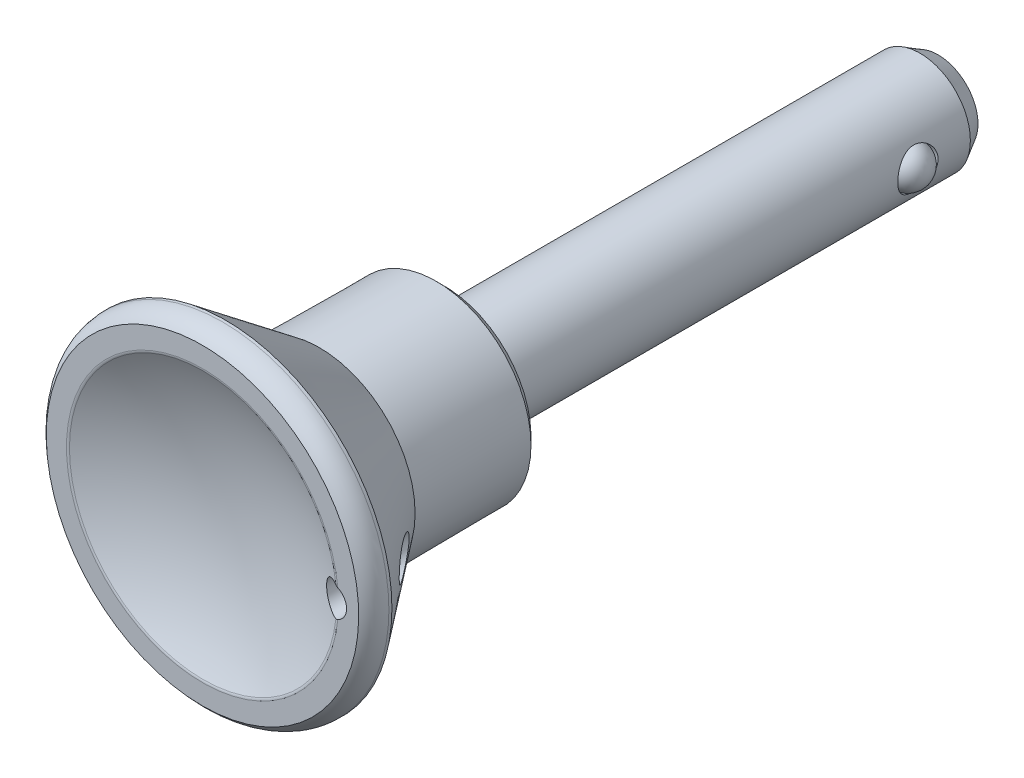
ISO-10303-21;
HEADER;
FILE_DESCRIPTION(('STEP AP214'),'2;1');
FILE_NAME('part.step','',(''),(''),'','','');
FILE_SCHEMA(('AUTOMOTIVE_DESIGN { 1 0 10303 214 1 1 1 1 }'));
ENDSEC;
DATA;
#1=APPLICATION_CONTEXT('core data for automotive mechanical design processes');
#2=APPLICATION_PROTOCOL_DEFINITION('international standard','automotive_design',2000,#1);
#3=PRODUCT_CONTEXT('',#1,'mechanical');
#4=PRODUCT('Part','Part','',(#3));
#5=PRODUCT_RELATED_PRODUCT_CATEGORY('part','',(#4));
#6=PRODUCT_DEFINITION_FORMATION('','',#4);
#7=PRODUCT_DEFINITION_CONTEXT('part definition',#1,'design');
#8=PRODUCT_DEFINITION('design','',#6,#7);
#9=PRODUCT_DEFINITION_SHAPE('','',#8);
#10=(LENGTH_UNIT() NAMED_UNIT(*) SI_UNIT(.MILLI.,.METRE.));
#11=(NAMED_UNIT(*) PLANE_ANGLE_UNIT() SI_UNIT($,.RADIAN.));
#12=(NAMED_UNIT(*) SI_UNIT($,.STERADIAN.) SOLID_ANGLE_UNIT());
#13=UNCERTAINTY_MEASURE_WITH_UNIT(LENGTH_MEASURE(1.E-05),#10,'distance_accuracy_value','');
#14=(GEOMETRIC_REPRESENTATION_CONTEXT(3) GLOBAL_UNCERTAINTY_ASSIGNED_CONTEXT((#13)) GLOBAL_UNIT_ASSIGNED_CONTEXT((#10,
#11,#12)) REPRESENTATION_CONTEXT('',''));
#15=CARTESIAN_POINT('',(0.,0.,0.));
#16=DIRECTION('',(0.,0.,1.));
#17=DIRECTION('',(1.,0.,0.));
#18=AXIS2_PLACEMENT_3D('',#15,#16,#17);
#19=CARTESIAN_POINT('',(0.,0.,23.5));
#20=DIRECTION('',(0.,0.,1.));
#21=DIRECTION('',(0.,-1.,0.));
#22=AXIS2_PLACEMENT_3D('',#19,#20,#21);
#23=TOROIDAL_SURFACE('',#22,13.4996296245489,0.50000000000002);
#24=CARTESIAN_POINT('',(13.1832697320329,1.4502083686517,23.940350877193));
#25=CARTESIAN_POINT('',(13.1967898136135,1.44663630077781,23.9473693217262));
#26=CARTESIAN_POINT('',(13.2105528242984,1.44279517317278,23.9537540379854));
#27=CARTESIAN_POINT('',(13.2384329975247,1.43456873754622,23.9652617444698));
#28=CARTESIAN_POINT('',(13.2525500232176,1.43018363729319,23.9703852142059));
#29=CARTESIAN_POINT('',(13.294658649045,1.41639274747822,23.9836925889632));
#30=CARTESIAN_POINT('',(13.322980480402,1.40620303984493,23.9901034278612));
#31=CARTESIAN_POINT('',(13.3645007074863,1.38980064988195,23.9961744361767));
#32=CARTESIAN_POINT('',(13.377775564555,1.38433480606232,23.9976116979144));
#33=CARTESIAN_POINT('',(13.4043485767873,1.37294329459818,23.9995283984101));
#34=CARTESIAN_POINT('',(13.4176457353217,1.3670137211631,23.999998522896));
#35=CARTESIAN_POINT('',(13.430859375,1.3608881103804,24.));
#36=B_SPLINE_CURVE_WITH_KNOTS('',3,(#24,#25,#26,#27,#28,#29,#30,#31,#32,#33,#34,#35),
.UNSPECIFIED.,.F.,.F.,(4,2,2,2,2,4),(0.,0.0468986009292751,0.0937793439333,0.185591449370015,
0.228845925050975,0.272515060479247),.UNSPECIFIED.);
#37=CARTESIAN_POINT('',(13.1832697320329,1.4502083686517,23.940350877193));
#38=VERTEX_POINT('',#37);
#39=CARTESIAN_POINT('',(13.430859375,1.36088811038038,24.));
#40=VERTEX_POINT('',#39);
#41=EDGE_CURVE('E60',#38,#40,#36,.T.);
#42=ORIENTED_EDGE('',*,*,#41,.T.);
#43=CARTESIAN_POINT('',(0.,0.,24.));
#44=DIRECTION('',(0.,0.,1.));
#45=DIRECTION('',(0.,-1.,0.));
#46=AXIS2_PLACEMENT_3D('',#43,#44,#45);
#47=CIRCLE('',#46,13.499629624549);
#48=CARTESIAN_POINT('',(13.430859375,-1.36088811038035,24.));
#49=VERTEX_POINT('',#48);
#50=EDGE_CURVE('E39',#49,#40,#47,.F.);
#51=ORIENTED_EDGE('',*,*,#50,.F.);
#52=CARTESIAN_POINT('',(13.430859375,-1.36088811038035,24.));
#53=CARTESIAN_POINT('',(13.4166665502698,-1.36746807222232,23.9999984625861));
#54=CARTESIAN_POINT('',(13.4023759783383,-1.37382175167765,23.9994558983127));
#55=CARTESIAN_POINT('',(13.3736641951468,-1.38605678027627,23.9972288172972));
#56=CARTESIAN_POINT('',(13.3592428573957,-1.39193760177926,23.9955430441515));
#57=CARTESIAN_POINT('',(13.316571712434,-1.4085689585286,23.9887845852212));
#58=CARTESIAN_POINT('',(13.2882736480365,-1.41860415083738,23.9820148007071));
#59=CARTESIAN_POINT('',(13.2473798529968,-1.43179699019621,23.9685266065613));
#60=CARTESIAN_POINT('',(13.2344037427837,-1.43578270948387,23.9636790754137));
#61=CARTESIAN_POINT('',(13.2086362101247,-1.44332889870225,23.9528611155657));
#62=CARTESIAN_POINT('',(13.1958479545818,-1.44688469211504,23.9468798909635));
#63=CARTESIAN_POINT('',(13.1832697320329,-1.45020836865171,23.940350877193));
#64=B_SPLINE_CURVE_WITH_KNOTS('',3,(#52,#53,#54,#55,#56,#57,#58,#59,#60,#61,#62,#63),
.UNSPECIFIED.,.F.,.F.,(4,2,2,2,2,4),(0.,0.0469051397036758,0.0938619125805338,0.185680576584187,
0.228880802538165,0.2725152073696),.UNSPECIFIED.);
#65=CARTESIAN_POINT('',(13.1832697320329,-1.4502083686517,23.940350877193));
#66=VERTEX_POINT('',#65);
#67=EDGE_CURVE('E20',#49,#66,#64,.T.);
#68=ORIENTED_EDGE('',*,*,#67,.T.);
#69=CARTESIAN_POINT('',(0.,0.,23.940350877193));
#70=DIRECTION('',(0.,0.,1.));
#71=DIRECTION('',(0.,-1.,0.));
#72=AXIS2_PLACEMENT_3D('',#69,#70,#71);
#73=CIRCLE('',#72,13.2627940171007);
#74=EDGE_CURVE('E54',#38,#66,#73,.T.);
#75=ORIENTED_EDGE('',*,*,#74,.F.);
#76=EDGE_LOOP('',(#42,#51,#68,#75));
#77=FACE_BOUND('',#76,.T.);
#78=ADVANCED_FACE('F15',(#77),#23,.T.);
#79=CARTESIAN_POINT('',(0.,0.,48.6));
#80=DIRECTION('',(0.,-1.,0.));
#81=DIRECTION('',(0.,0.,1.));
#82=AXIS2_PLACEMENT_3D('',#79,#80,#81);
#83=SPHERICAL_SURFACE('',#82,28.);
#84=CARTESIAN_POINT('',(13.1832697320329,1.4502083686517,23.940350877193));
#85=CARTESIAN_POINT('',(13.0915993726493,1.4744532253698,23.8927620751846));
#86=CARTESIAN_POINT('',(12.9980560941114,1.489860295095,23.8443501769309));
#87=CARTESIAN_POINT('',(12.8097591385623,1.50293318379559,23.7471842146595));
#88=CARTESIAN_POINT('',(12.7150040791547,1.50057651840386,23.6984297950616));
#89=CARTESIAN_POINT('',(12.5270201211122,1.47798913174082,23.6019874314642));
#90=CARTESIAN_POINT('',(12.4337919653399,1.45774995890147,23.5543000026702));
#91=CARTESIAN_POINT('',(12.2517517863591,1.39948117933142,23.4614379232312));
#92=CARTESIAN_POINT('',(12.1629377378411,1.36145981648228,23.416262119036));
#93=CARTESIAN_POINT('',(11.9952411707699,1.26934990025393,23.3311736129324));
#94=CARTESIAN_POINT('',(11.9161458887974,1.21575714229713,23.2911465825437));
#95=CARTESIAN_POINT('',(11.7681643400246,1.09295087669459,23.2164149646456));
#96=CARTESIAN_POINT('',(11.6992729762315,1.02374521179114,23.1817077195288));
#97=CARTESIAN_POINT('',(11.5811025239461,0.878735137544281,23.1222729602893));
#98=CARTESIAN_POINT('',(11.5305709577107,0.804216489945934,23.0969048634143));
#99=CARTESIAN_POINT('',(11.4431131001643,0.645771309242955,23.0530473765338));
#100=CARTESIAN_POINT('',(11.4061726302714,0.561854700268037,23.0345508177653));
#101=CARTESIAN_POINT('',(11.3518094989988,0.398913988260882,23.0073479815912));
#102=CARTESIAN_POINT('',(11.332464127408,0.32068873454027,22.9976766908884));
#103=CARTESIAN_POINT('',(11.3065630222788,0.161638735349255,22.9847305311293));
#104=CARTESIAN_POINT('',(11.3000015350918,0.0808151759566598,22.9814527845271));
#105=CARTESIAN_POINT('',(11.2999985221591,-0.0778011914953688,22.9814513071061));
#106=CARTESIAN_POINT('',(11.3060768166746,-0.155594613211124,22.9844877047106));
#107=CARTESIAN_POINT('',(11.3300927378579,-0.308850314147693,22.9964912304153));
#108=CARTESIAN_POINT('',(11.3480306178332,-0.384312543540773,23.0054584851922));
#109=CARTESIAN_POINT('',(11.3948947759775,-0.530632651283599,23.0289063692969));
#110=CARTESIAN_POINT('',(11.4237977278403,-0.601499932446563,23.0433752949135));
#111=CARTESIAN_POINT('',(11.4913996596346,-0.737094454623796,23.0772561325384));
#112=CARTESIAN_POINT('',(11.5301003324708,-0.801820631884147,23.0966688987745));
#113=CARTESIAN_POINT('',(11.6176766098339,-0.9263609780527,23.1406602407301));
#114=CARTESIAN_POINT('',(11.6669073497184,-0.98586052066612,23.1654195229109));
#115=CARTESIAN_POINT('',(11.7728262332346,-1.09578522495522,23.2187793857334));
#116=CARTESIAN_POINT('',(11.8295165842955,-1.14620769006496,23.2473811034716));
#117=CARTESIAN_POINT('',(11.9547131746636,-1.24189507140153,23.3106654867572));
#118=CARTESIAN_POINT('',(12.0238340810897,-1.28614058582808,23.3456702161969));
#119=CARTESIAN_POINT('',(12.1672246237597,-1.36242212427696,23.4184517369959));
#120=CARTESIAN_POINT('',(12.2414976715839,-1.39444996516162,23.4562303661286));
#121=CARTESIAN_POINT('',(12.3592920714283,-1.4344825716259,23.5162885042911));
#122=CARTESIAN_POINT('',(12.4017101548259,-1.44682505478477,23.5379430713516));
#123=CARTESIAN_POINT('',(12.4872184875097,-1.4676864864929,23.5816530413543));
#124=CARTESIAN_POINT('',(12.5303081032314,-1.47620883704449,23.603708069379));
#125=CARTESIAN_POINT('',(12.6602504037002,-1.49604024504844,23.6703078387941));
#126=CARTESIAN_POINT('',(12.7478240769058,-1.50162964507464,23.7153114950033));
#127=CARTESIAN_POINT('',(12.8938293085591,-1.49821627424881,23.7905484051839));
#128=CARTESIAN_POINT('',(12.9524047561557,-1.49339577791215,23.8207882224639));
#129=CARTESIAN_POINT('',(13.0686394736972,-1.47691090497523,23.8809033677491));
#130=CARTESIAN_POINT('',(13.1263001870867,-1.46525870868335,23.9107792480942));
#131=CARTESIAN_POINT('',(13.1832697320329,-1.4502083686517,23.9403508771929));
#132=B_SPLINE_CURVE_WITH_KNOTS('',3,(#84,#85,#86,#87,#88,#89,#90,#91,#92,#93,#94,#95,#96,#97,
#98,#99,#100,#101,#102,#103,#104,#105,#106,#107,#108,#109,#110,#111,#112,#113,#114,#115,#116,
#117,#118,#119,#120,#121,#122,#123,#124,#125,#126,#127,#128,#129,#130,#131),.UNSPECIFIED.,.F.,
.F.,(4,2,2,2,2,2,2,2,2,2,2,2,2,2,2,2,2,2,2,2,2,2,2,4),(0.,0.317865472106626,0.636133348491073,
0.954551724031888,1.27282262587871,1.58190076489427,1.89082399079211,2.16986616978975,
2.44861641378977,2.69085568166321,2.93298589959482,3.16608592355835,3.39919092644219,
3.63180279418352,3.8644548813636,4.10674626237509,4.34910950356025,4.61569988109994,
4.88246850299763,5.02992533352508,5.17725058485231,5.4717357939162,5.66970066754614,
5.86731365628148),.UNSPECIFIED.);
#133=EDGE_CURVE('E50',#38,#66,#132,.T.);
#134=ORIENTED_EDGE('',*,*,#133,.F.);
#135=ORIENTED_EDGE('',*,*,#74,.T.);
#136=EDGE_LOOP('',(#134,#135));
#137=FACE_BOUND('',#136,.T.);
#138=ADVANCED_FACE('F52',(#137),#83,.F.);
#139=CARTESIAN_POINT('',(-15.81,-15.5,24.));
#140=CARTESIAN_POINT('',(-15.5,-15.5,24.));
#141=CARTESIAN_POINT('',(15.5,-15.5,24.));
#142=B_SPLINE_CURVE_WITH_KNOTS('',1,(#139,#140,#141),.UNSPECIFIED.,.F.,.F.,(2,1,2),(-0.01,0.,
1.),.UNSPECIFIED.);
#143=DIRECTION('',(0.,1.,0.));
#144=VECTOR('',#143,1.);
#145=SURFACE_OF_LINEAR_EXTRUSION('',#142,#144);
#146=CARTESIAN_POINT('',(12.8,0.,24.));
#147=DIRECTION('',(0.,0.,1.));
#148=DIRECTION('',(0.,-1.,0.));
#149=AXIS2_PLACEMENT_3D('',#146,#147,#148);
#150=CIRCLE('',#149,1.5);
#151=EDGE_CURVE('E57',#49,#40,#150,.T.);
#152=ORIENTED_EDGE('',*,*,#151,.F.);
#153=ORIENTED_EDGE('',*,*,#50,.T.);
#154=EDGE_LOOP('',(#152,#153));
#155=FACE_BOUND('',#154,.T.);
#156=CARTESIAN_POINT('',(0.,0.,24.));
#157=DIRECTION('',(0.,0.,1.));
#158=DIRECTION('',(0.,-1.,0.));
#159=AXIS2_PLACEMENT_3D('',#156,#157,#158);
#160=CIRCLE('',#159,15.5);
#161=CARTESIAN_POINT('',(0.,-15.5,24.));
#162=VERTEX_POINT('',#161);
#163=EDGE_CURVE('E58',#162,#162,#160,.F.);
#164=ORIENTED_EDGE('',*,*,#163,.F.);
#165=EDGE_LOOP('',(#164));
#166=FACE_BOUND('',#165,.T.);
#167=ADVANCED_FACE('F192',(#155,#166),#145,.T.);
#168=CARTESIAN_POINT('',(0.,0.,22.));
#169=DIRECTION('',(0.,0.,1.));
#170=DIRECTION('',(0.,-1.,0.));
#171=AXIS2_PLACEMENT_3D('',#168,#169,#170);
#172=TOROIDAL_SURFACE('',#171,14.,2.5);
#173=ORIENTED_EDGE('',*,*,#163,.T.);
#174=EDGE_LOOP('',(#173));
#175=FACE_BOUND('',#174,.T.);
#176=CARTESIAN_POINT('',(0.,0.,22.));
#177=DIRECTION('',(0.,0.,1.));
#178=DIRECTION('',(1.,0.,0.));
#179=AXIS2_PLACEMENT_3D('',#176,#177,#178);
#180=CIRCLE('',#179,16.5);
#181=CARTESIAN_POINT('',(16.5,0.,22.));
#182=VERTEX_POINT('',#181);
#183=EDGE_CURVE('E101',#182,#182,#180,.F.);
#184=ORIENTED_EDGE('',*,*,#183,.F.);
#185=EDGE_LOOP('',(#184));
#186=FACE_BOUND('',#185,.T.);
#187=ADVANCED_FACE('F79',(#175,#186),#172,.T.);
#188=CARTESIAN_POINT('',(12.8,0.,14.7910576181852));
#189=DIRECTION('',(0.,0.,1.));
#190=DIRECTION('',(0.,-1.,0.));
#191=AXIS2_PLACEMENT_3D('',#188,#189,#190);
#192=CYLINDRICAL_SURFACE('',#191,1.5);
#193=CARTESIAN_POINT('',(12.62421875,-1.48966471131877,16.6671130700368));
#194=CARTESIAN_POINT('',(12.6920032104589,-1.49766166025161,16.7577945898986));
#195=CARTESIAN_POINT('',(12.7603283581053,-1.50104579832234,16.8484671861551));
#196=CARTESIAN_POINT('',(12.897645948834,-1.49839397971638,17.0292601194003));
#197=CARTESIAN_POINT('',(12.9666387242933,-1.49235306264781,17.1193801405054));
#198=CARTESIAN_POINT('',(13.1046564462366,-1.47039580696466,17.2982798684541));
#199=CARTESIAN_POINT('',(13.1736813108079,-1.45448817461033,17.3870606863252));
#200=CARTESIAN_POINT('',(13.3110827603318,-1.41207641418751,17.5624849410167));
#201=CARTESIAN_POINT('',(13.3794598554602,-1.38558148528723,17.6491301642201));
#202=CARTESIAN_POINT('',(13.5187485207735,-1.31898430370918,17.8243946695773));
#203=CARTESIAN_POINT('',(13.5895656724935,-1.27816038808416,17.9128199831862));
#204=CARTESIAN_POINT('',(13.7277317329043,-1.18169522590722,18.084148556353));
#205=CARTESIAN_POINT('',(13.7950853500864,-1.12607476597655,18.1670593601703));
#206=CARTESIAN_POINT('',(13.9084086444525,-1.01303116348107,18.3057043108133));
#207=CARTESIAN_POINT('',(13.9556726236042,-0.959133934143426,18.3632332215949));
#208=CARTESIAN_POINT('',(14.0446143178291,-0.840483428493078,18.471045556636));
#209=CARTESIAN_POINT('',(14.0863013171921,-0.77574860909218,18.5213410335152));
#210=CARTESIAN_POINT('',(14.1507925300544,-0.65471783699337,18.5988956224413));
#211=CARTESIAN_POINT('',(14.1756178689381,-0.601120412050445,18.6286642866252));
#212=CARTESIAN_POINT('',(14.2195452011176,-0.488403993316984,18.6812412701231));
#213=CARTESIAN_POINT('',(14.238652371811,-0.429290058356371,18.7040558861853));
#214=CARTESIAN_POINT('',(14.2689681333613,-0.309460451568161,18.7402118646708));
#215=CARTESIAN_POINT('',(14.2805052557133,-0.248950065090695,18.7539474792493));
#216=CARTESIAN_POINT('',(14.2960184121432,-0.12562551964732,18.77240966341));
#217=CARTESIAN_POINT('',(14.3000000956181,-0.0628131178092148,18.7771429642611));
#218=CARTESIAN_POINT('',(14.2999999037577,0.0632231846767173,18.7771427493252));
#219=CARTESIAN_POINT('',(14.2959658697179,0.126447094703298,18.7723472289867));
#220=CARTESIAN_POINT('',(14.2802519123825,0.250551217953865,18.7536458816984));
#221=CARTESIAN_POINT('',(14.2685662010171,0.311429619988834,18.7397331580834));
#222=CARTESIAN_POINT('',(14.2387365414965,0.428564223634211,18.7041556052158));
#223=CARTESIAN_POINT('',(14.2206451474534,0.484853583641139,18.6825538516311));
#224=CARTESIAN_POINT('',(14.1792492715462,0.592453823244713,18.633014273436));
#225=CARTESIAN_POINT('',(14.1559422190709,0.643762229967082,18.6050733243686));
#226=CARTESIAN_POINT('',(14.0931329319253,0.764461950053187,18.5295741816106));
#227=CARTESIAN_POINT('',(14.0512237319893,0.830727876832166,18.4790335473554));
#228=CARTESIAN_POINT('',(13.9615408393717,0.952125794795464,18.370367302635));
#229=CARTESIAN_POINT('',(13.9137529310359,1.00722990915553,18.3122232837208));
#230=CARTESIAN_POINT('',(13.7883270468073,1.13348006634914,18.158818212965));
#231=CARTESIAN_POINT('',(13.708179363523,1.1978805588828,18.0600849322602));
#232=CARTESIAN_POINT('',(13.5435609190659,1.3064664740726,17.8554996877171));
#233=CARTESIAN_POINT('',(13.4590828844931,1.35061655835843,17.7496356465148));
#234=CARTESIAN_POINT('',(13.3107013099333,1.41202717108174,17.5619635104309));
#235=CARTESIAN_POINT('',(13.2471965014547,1.43330058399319,17.4811068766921));
#236=CARTESIAN_POINT('',(13.1198264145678,1.46698834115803,17.3177942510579));
#237=CARTESIAN_POINT('',(13.0559609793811,1.47939847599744,17.2353375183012));
#238=CARTESIAN_POINT('',(12.9282718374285,1.49589397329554,17.0692879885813));
#239=CARTESIAN_POINT('',(12.8644485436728,1.49996064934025,16.9856930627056));
#240=CARTESIAN_POINT('',(12.7374091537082,1.50003877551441,16.8180712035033));
#241=CARTESIAN_POINT('',(12.6741929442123,1.49605175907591,16.7340443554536));
#242=CARTESIAN_POINT('',(12.5469978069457,1.47993658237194,16.5637117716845));
#243=CARTESIAN_POINT('',(12.4830456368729,1.46758777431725,16.4774068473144));
#244=CARTESIAN_POINT('',(12.3565302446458,1.43443826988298,16.3053467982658));
#245=CARTESIAN_POINT('',(12.2939675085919,1.41363466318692,16.2195918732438));
#246=CARTESIAN_POINT('',(12.1709555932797,1.36334219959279,16.0496685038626));
#247=CARTESIAN_POINT('',(12.1104987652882,1.33388949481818,15.9654949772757));
#248=CARTESIAN_POINT('',(11.9920388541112,1.26565016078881,15.7992974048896));
#249=CARTESIAN_POINT('',(11.9340336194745,1.22687192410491,15.7172714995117));
#250=CARTESIAN_POINT('',(11.8266654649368,1.14315320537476,15.5643050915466));
#251=CARTESIAN_POINT('',(11.7770073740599,1.09916121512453,15.4930561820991));
#252=CARTESIAN_POINT('',(11.6811267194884,1.0014126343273,15.3545942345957));
#253=CARTESIAN_POINT('',(11.6349116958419,0.947635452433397,15.2873901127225));
#254=CARTESIAN_POINT('',(11.569142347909,0.858125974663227,15.1911821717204));
#255=CARTESIAN_POINT('',(11.5476572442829,0.826531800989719,15.1596504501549));
#256=CARTESIAN_POINT('',(11.5063433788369,0.760253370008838,15.0988444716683));
#257=CARTESIAN_POINT('',(11.4865152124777,0.725568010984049,15.0695710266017));
#258=CARTESIAN_POINT('',(11.4302732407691,0.616814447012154,14.9863165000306));
#259=CARTESIAN_POINT('',(11.3967954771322,0.537651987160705,14.9364517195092));
#260=CARTESIAN_POINT('',(11.3555291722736,0.407099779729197,14.8747804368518));
#261=CARTESIAN_POINT('',(11.3430899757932,0.360365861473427,14.856144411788));
#262=CARTESIAN_POINT('',(11.3225831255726,0.263914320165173,14.8253840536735));
#263=CARTESIAN_POINT('',(11.3145046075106,0.214204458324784,14.8132435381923));
#264=CARTESIAN_POINT('',(11.3059949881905,0.136701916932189,14.8004485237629));
#265=CARTESIAN_POINT('',(11.3037543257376,0.109528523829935,14.7970776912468));
#266=CARTESIAN_POINT('',(11.300755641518,0.0549082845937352,14.7925658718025));
#267=CARTESIAN_POINT('',(11.2999979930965,0.0274613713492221,14.791425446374));
#268=CARTESIAN_POINT('',(11.3000036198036,-0.0495314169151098,14.7914342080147));
#269=CARTESIAN_POINT('',(11.3024785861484,-0.0991098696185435,14.7951600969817));
#270=CARTESIAN_POINT('',(11.3121472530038,-0.196763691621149,14.8096998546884));
#271=CARTESIAN_POINT('',(11.3193489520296,-0.244836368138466,14.8205257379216));
#272=CARTESIAN_POINT('',(11.3399096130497,-0.348584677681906,14.851379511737));
#273=CARTESIAN_POINT('',(11.3542736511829,-0.403610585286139,14.8729064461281));
#274=CARTESIAN_POINT('',(11.387815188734,-0.50871821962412,14.9230284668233));
#275=CARTESIAN_POINT('',(11.4070004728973,-0.558791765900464,14.9516349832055));
#276=CARTESIAN_POINT('',(11.4595328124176,-0.677671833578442,15.0296959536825));
#277=CARTESIAN_POINT('',(11.4951602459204,-0.74330038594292,15.0824162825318));
#278=CARTESIAN_POINT('',(11.5718624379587,-0.864190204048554,15.1952386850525));
#279=CARTESIAN_POINT('',(11.6129512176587,-0.919423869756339,15.2553597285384));
#280=CARTESIAN_POINT('',(11.6921657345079,-1.01283475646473,15.3705343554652));
#281=CARTESIAN_POINT('',(11.7297508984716,-1.05232856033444,15.4249113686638));
#282=CARTESIAN_POINT('',(11.8070065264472,-1.12552131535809,15.5360737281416));
#283=CARTESIAN_POINT('',(11.8466784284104,-1.15921620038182,15.5928607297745));
#284=CARTESIAN_POINT('',(11.9276586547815,-1.22132048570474,15.7081342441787));
#285=CARTESIAN_POINT('',(11.9689673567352,-1.24972865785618,15.7666211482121));
#286=CARTESIAN_POINT('',(12.0529136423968,-1.30165144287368,15.884812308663));
#287=CARTESIAN_POINT('',(12.0955516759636,-1.32516437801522,15.9445169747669));
#288=CARTESIAN_POINT('',(12.2167649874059,-1.38470455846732,16.1132939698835));
#289=CARTESIAN_POINT('',(12.2965837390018,-1.41552588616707,16.2233378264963));
#290=CARTESIAN_POINT('',(12.458735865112,-1.46310486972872,16.4446295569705));
#291=CARTESIAN_POINT('',(12.5410705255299,-1.47985520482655,16.5558780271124));
#292=CARTESIAN_POINT('',(12.62421875,-1.48966471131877,16.6671130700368));
#293=B_SPLINE_CURVE_WITH_KNOTS('',3,(#193,#194,#195,#196,#197,#198,#199,#200,#201,#202,#203,
#204,#205,#206,#207,#208,#209,#210,#211,#212,#213,#214,#215,#216,#217,#218,#219,#220,#221,#222,
#223,#224,#225,#226,#227,#228,#229,#230,#231,#232,#233,#234,#235,#236,#237,#238,#239,#240,#241,
#242,#243,#244,#245,#246,#247,#248,#249,#250,#251,#252,#253,#254,#255,#256,#257,#258,#259,#260,
#261,#262,#263,#264,#265,#266,#267,#268,#269,#270,#271,#272,#273,#274,#275,#276,#277,#278,#279,
#280,#281,#282,#283,#284,#285,#286,#287,#288,#289,#290,#291,#292),.UNSPECIFIED.,.T.,.F.,(4,2,2,
2,2,2,2,2,2,2,2,2,2,2,2,2,2,2,2,2,2,2,2,2,2,2,2,2,2,2,2,2,2,2,2,2,2,2,2,2,2,2,2,2,2,2,2,2,2,4),
(0.,0.3403810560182,0.680941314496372,1.02120149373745,1.36116666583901,1.72154948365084,
2.08142867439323,2.35634247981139,2.63079277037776,2.82853330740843,3.02609425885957,
3.21438583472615,3.40253656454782,3.59191561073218,3.78143807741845,3.96944036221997,
4.15753551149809,4.43581804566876,4.71478725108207,5.14007838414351,5.56610888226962,
5.88069336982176,6.19542716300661,6.51086508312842,6.82624294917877,7.15028500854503,
7.47443870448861,7.79725631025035,8.11978447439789,8.41136093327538,8.70355821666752,
8.8520054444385,9.00050579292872,9.29551066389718,9.45047012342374,9.60504170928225,
9.6873437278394,9.76966646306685,9.91815000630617,10.0668854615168,10.2482950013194,
10.4299993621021,10.702706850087,10.9761285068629,11.2068168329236,11.4376662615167,
11.6685692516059,11.8995512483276,12.3168647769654,12.7343952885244),.UNSPECIFIED.);
#294=CARTESIAN_POINT('',(12.62421875,-1.48966471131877,16.6671130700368));
#295=VERTEX_POINT('',#294);
#296=EDGE_CURVE('E93',#295,#295,#293,.T.);
#297=ORIENTED_EDGE('',*,*,#296,.F.);
#298=EDGE_LOOP('',(#297));
#299=FACE_BOUND('',#298,.T.);
#300=ORIENTED_EDGE('',*,*,#67,.F.);
#301=ORIENTED_EDGE('',*,*,#151,.T.);
#302=ORIENTED_EDGE('',*,*,#41,.F.);
#303=ORIENTED_EDGE('',*,*,#133,.T.);
#304=EDGE_LOOP('',(#300,#301,#302,#303));
#305=FACE_BOUND('',#304,.T.);
#306=ADVANCED_FACE('F61',(#299,#305),#192,.F.);
#307=CARTESIAN_POINT('',(0.,0.,22.));
#308=DIRECTION('',(0.,0.,1.));
#309=DIRECTION('',(0.,-1.,0.));
#310=AXIS2_PLACEMENT_3D('',#307,#308,#309);
#311=CYLINDRICAL_SURFACE('',#310,16.5);
#312=ORIENTED_EDGE('',*,*,#183,.T.);
#313=EDGE_LOOP('',(#312));
#314=FACE_BOUND('',#313,.T.);
#315=CARTESIAN_POINT('',(0.,0.,21.7));
#316=DIRECTION('',(0.,0.,-1.));
#317=DIRECTION('',(1.,0.,0.));
#318=AXIS2_PLACEMENT_3D('',#315,#316,#317);
#319=CIRCLE('',#318,16.5);
#320=CARTESIAN_POINT('',(16.5,0.,21.7));
#321=VERTEX_POINT('',#320);
#322=EDGE_CURVE('E100',#321,#321,#319,.T.);
#323=ORIENTED_EDGE('',*,*,#322,.F.);
#324=EDGE_LOOP('',(#323));
#325=FACE_BOUND('',#324,.T.);
#326=ADVANCED_FACE('F78',(#314,#325),#311,.T.);
#327=CARTESIAN_POINT('',(0.,0.,12.4));
#328=DIRECTION('',(0.,0.,1.));
#329=DIRECTION('',(0.,-1.,0.));
#330=AXIS2_PLACEMENT_3D('',#327,#328,#329);
#331=CONICAL_SURFACE('',#330,9.5,0.645219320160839);
#332=ORIENTED_EDGE('',*,*,#296,.T.);
#333=EDGE_LOOP('',(#332));
#334=FACE_BOUND('',#333,.T.);
#335=ORIENTED_EDGE('',*,*,#322,.T.);
#336=EDGE_LOOP('',(#335));
#337=FACE_BOUND('',#336,.T.);
#338=CARTESIAN_POINT('',(0.,0.,12.4));
#339=DIRECTION('',(0.,0.,-1.));
#340=DIRECTION('',(1.,0.,0.));
#341=AXIS2_PLACEMENT_3D('',#338,#339,#340);
#342=CIRCLE('',#341,9.5);
#343=CARTESIAN_POINT('',(9.5,0.,12.4));
#344=VERTEX_POINT('',#343);
#345=EDGE_CURVE('E173',#344,#344,#342,.T.);
#346=ORIENTED_EDGE('',*,*,#345,.F.);
#347=EDGE_LOOP('',(#346));
#348=FACE_BOUND('',#347,.T.);
#349=ADVANCED_FACE('F102',(#334,#337,#348),#331,.T.);
#350=CARTESIAN_POINT('',(0.,0.,0.799969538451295));
#351=DIRECTION('',(0.,0.,1.));
#352=DIRECTION('',(0.,-1.,0.));
#353=AXIS2_PLACEMENT_3D('',#350,#351,#352);
#354=CONICAL_SURFACE('',#353,9.39876806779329,0.00872664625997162);
#355=ORIENTED_EDGE('',*,*,#345,.T.);
#356=EDGE_LOOP('',(#355));
#357=FACE_BOUND('',#356,.T.);
#358=CARTESIAN_POINT('',(0.,0.,0.799969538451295));
#359=DIRECTION('',(0.,0.,-1.));
#360=DIRECTION('',(1.,0.,0.));
#361=AXIS2_PLACEMENT_3D('',#358,#359,#360);
#362=CIRCLE('',#361,9.39876806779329);
#363=CARTESIAN_POINT('',(9.39876806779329,0.,0.799969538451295));
#364=VERTEX_POINT('',#363);
#365=EDGE_CURVE('E169',#364,#364,#362,.T.);
#366=ORIENTED_EDGE('',*,*,#365,.F.);
#367=EDGE_LOOP('',(#366));
#368=FACE_BOUND('',#367,.T.);
#369=ADVANCED_FACE('F106',(#357,#368),#354,.T.);
#370=CARTESIAN_POINT('',(0.,0.,0.));
#371=DIRECTION('',(0.,0.,1.));
#372=DIRECTION('',(0.,-1.,0.));
#373=AXIS2_PLACEMENT_3D('',#370,#371,#372);
#374=CONICAL_SURFACE('',#373,8.59178683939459,0.789761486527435);
#375=ORIENTED_EDGE('',*,*,#365,.T.);
#376=EDGE_LOOP('',(#375));
#377=FACE_BOUND('',#376,.T.);
#378=CARTESIAN_POINT('',(0.,0.,0.));
#379=DIRECTION('',(0.,0.,1.));
#380=DIRECTION('',(0.,-1.,0.));
#381=AXIS2_PLACEMENT_3D('',#378,#379,#380);
#382=CIRCLE('',#381,8.59178683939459);
#383=CARTESIAN_POINT('',(0.,-8.59178683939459,0.));
#384=VERTEX_POINT('',#383);
#385=EDGE_CURVE('E32',#384,#384,#382,.F.);
#386=ORIENTED_EDGE('',*,*,#385,.F.);
#387=EDGE_LOOP('',(#386));
#388=FACE_BOUND('',#387,.T.);
#389=ADVANCED_FACE('F110',(#377,#388),#374,.T.);
#390=CARTESIAN_POINT('',(8.5917868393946,-8.69489038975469,0.));
#391=DIRECTION('',(0.,0.,-1.));
#392=DIRECTION('',(-1.,0.,0.));
#393=AXIS2_PLACEMENT_3D('',#390,#391,#392);
#394=PLANE('',#393);
#395=CARTESIAN_POINT('',(0.,0.,0.));
#396=DIRECTION('',(0.,0.,1.));
#397=DIRECTION('',(0.,-1.,0.));
#398=AXIS2_PLACEMENT_3D('',#395,#396,#397);
#399=CIRCLE('',#398,5.);
#400=CARTESIAN_POINT('',(0.,-5.,0.));
#401=VERTEX_POINT('',#400);
#402=EDGE_CURVE('E9',#401,#401,#399,.F.);
#403=ORIENTED_EDGE('',*,*,#402,.F.);
#404=EDGE_LOOP('',(#403));
#405=FACE_BOUND('',#404,.T.);
#406=ORIENTED_EDGE('',*,*,#385,.T.);
#407=EDGE_LOOP('',(#406));
#408=FACE_BOUND('',#407,.T.);
#409=ADVANCED_FACE('F114',(#405,#408),#394,.T.);
#410=CARTESIAN_POINT('',(0.,0.,0.));
#411=DIRECTION('',(0.,0.,1.));
#412=DIRECTION('',(0.,-1.,0.));
#413=AXIS2_PLACEMENT_3D('',#410,#411,#412);
#414=CYLINDRICAL_SURFACE('',#413,5.);
#415=ORIENTED_EDGE('',*,*,#402,.T.);
#416=EDGE_LOOP('',(#415));
#417=FACE_BOUND('',#416,.T.);
#418=CARTESIAN_POINT('',(5.,0.,-40.));
#419=CARTESIAN_POINT('',(4.99999504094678,0.107615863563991,-40.0000062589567));
#420=CARTESIAN_POINT('',(4.99648897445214,0.215325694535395,-40.0087281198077));
#421=CARTESIAN_POINT('',(4.98282088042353,0.427616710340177,-40.0432818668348));
#422=CARTESIAN_POINT('',(4.97264930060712,0.532193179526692,-40.0691383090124));
#423=CARTESIAN_POINT('',(4.94674442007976,0.734940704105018,-40.1368701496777));
#424=CARTESIAN_POINT('',(4.93102668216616,0.8331287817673,-40.1787007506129));
#425=CARTESIAN_POINT('',(4.89557266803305,1.02104090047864,-40.2770003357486));
#426=CARTESIAN_POINT('',(4.87583644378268,1.11076505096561,-40.3334691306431));
#427=CARTESIAN_POINT('',(4.83330802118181,1.28350477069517,-40.4622380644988));
#428=CARTESIAN_POINT('',(4.8104211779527,1.36606882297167,-40.5351123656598));
#429=CARTESIAN_POINT('',(4.76460397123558,1.5181803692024,-40.6934066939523));
#430=CARTESIAN_POINT('',(4.74167359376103,1.58772251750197,-40.7788318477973));
#431=CARTESIAN_POINT('',(4.69722807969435,1.71487412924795,-40.9644273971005));
#432=CARTESIAN_POINT('',(4.67582146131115,1.77181418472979,-41.0650850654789));
#433=CARTESIAN_POINT('',(4.63833669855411,1.86775416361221,-41.2755348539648));
#434=CARTESIAN_POINT('',(4.62225609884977,1.90676235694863,-41.3853227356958));
#435=CARTESIAN_POINT('',(4.59826357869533,1.96389881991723,-41.6057123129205));
#436=CARTESIAN_POINT('',(4.59001420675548,1.98289395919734,-41.7160511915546));
#437=CARTESIAN_POINT('',(4.58164004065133,2.00217296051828,-41.9386349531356));
#438=CARTESIAN_POINT('',(4.5815112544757,2.00246601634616,-42.0508788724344));
#439=CARTESIAN_POINT('',(4.58910500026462,1.9849893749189,-42.2657566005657));
#440=CARTESIAN_POINT('',(4.59628174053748,1.96847534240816,-42.3685155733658));
#441=CARTESIAN_POINT('',(4.61676185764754,1.91994691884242,-42.5696594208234));
#442=CARTESIAN_POINT('',(4.63006631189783,1.8879298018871,-42.6680435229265));
#443=CARTESIAN_POINT('',(4.66159517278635,1.80869394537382,-42.8600197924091));
#444=CARTESIAN_POINT('',(4.67991453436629,1.76117802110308,-42.9534730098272));
#445=CARTESIAN_POINT('',(4.71938201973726,1.65250390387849,-43.1314192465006));
#446=CARTESIAN_POINT('',(4.74053109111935,1.59134113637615,-43.2159092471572));
#447=CARTESIAN_POINT('',(4.78526406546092,1.45156124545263,-43.3803975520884));
#448=CARTESIAN_POINT('',(4.80890991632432,1.37196139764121,-43.4595460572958));
#449=CARTESIAN_POINT('',(4.8545919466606,1.20033946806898,-43.6036660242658));
#450=CARTESIAN_POINT('',(4.87662734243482,1.10831139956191,-43.6686306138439));
#451=CARTESIAN_POINT('',(4.91716230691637,0.912007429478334,-43.7836609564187));
#452=CARTESIAN_POINT('',(4.93558065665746,0.80752012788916,-43.8333960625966));
#453=CARTESIAN_POINT('',(4.96616672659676,0.590835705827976,-43.9142166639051));
#454=CARTESIAN_POINT('',(4.97834697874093,0.478654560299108,-43.9453395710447));
#455=CARTESIAN_POINT('',(4.99108567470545,0.304486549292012,-43.9776312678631));
#456=CARTESIAN_POINT('',(4.99441629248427,0.243952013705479,-43.9860060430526));
#457=CARTESIAN_POINT('',(4.99887485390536,0.122288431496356,-43.9971921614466));
#458=CARTESIAN_POINT('',(5.00000281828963,0.0611593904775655,-44.0000035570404));
#459=CARTESIAN_POINT('',(4.99999504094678,-0.1076158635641,-43.9999937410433));
#460=CARTESIAN_POINT('',(4.99648897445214,-0.215325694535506,-43.9912718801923));
#461=CARTESIAN_POINT('',(4.98282088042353,-0.427616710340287,-43.9567181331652));
#462=CARTESIAN_POINT('',(4.97264930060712,-0.532193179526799,-43.9308616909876));
#463=CARTESIAN_POINT('',(4.94674442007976,-0.734940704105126,-43.8631298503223));
#464=CARTESIAN_POINT('',(4.93102668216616,-0.833128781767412,-43.8212992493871));
#465=CARTESIAN_POINT('',(4.89557266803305,-1.02104090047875,-43.7229996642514));
#466=CARTESIAN_POINT('',(4.87583644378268,-1.11076505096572,-43.6665308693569));
#467=CARTESIAN_POINT('',(4.83330802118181,-1.28350477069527,-43.5377619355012));
#468=CARTESIAN_POINT('',(4.8104211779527,-1.36606882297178,-43.4648876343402));
#469=CARTESIAN_POINT('',(4.76460397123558,-1.51818036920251,-43.3065933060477));
#470=CARTESIAN_POINT('',(4.74167359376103,-1.58772251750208,-43.2211681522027));
#471=CARTESIAN_POINT('',(4.69722807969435,-1.71487412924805,-43.0355726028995));
#472=CARTESIAN_POINT('',(4.67582146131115,-1.77181418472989,-42.9349149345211));
#473=CARTESIAN_POINT('',(4.63833669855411,-1.86775416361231,-42.7244651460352));
#474=CARTESIAN_POINT('',(4.62225609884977,-1.90676235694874,-42.6146772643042));
#475=CARTESIAN_POINT('',(4.59826357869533,-1.96389881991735,-42.3942876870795));
#476=CARTESIAN_POINT('',(4.59001420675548,-1.98289395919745,-42.2839488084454));
#477=CARTESIAN_POINT('',(4.58164004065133,-2.00217296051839,-42.0613650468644));
#478=CARTESIAN_POINT('',(4.58151125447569,-2.00246601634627,-41.9491211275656));
#479=CARTESIAN_POINT('',(4.58910500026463,-1.98498937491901,-41.7342433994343));
#480=CARTESIAN_POINT('',(4.59628174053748,-1.96847534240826,-41.6314844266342));
#481=CARTESIAN_POINT('',(4.61676185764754,-1.91994691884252,-41.4303405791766));
#482=CARTESIAN_POINT('',(4.63006631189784,-1.88792980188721,-41.3319564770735));
#483=CARTESIAN_POINT('',(4.66159517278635,-1.80869394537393,-41.1399802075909));
#484=CARTESIAN_POINT('',(4.67991453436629,-1.76117802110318,-41.0465269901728));
#485=CARTESIAN_POINT('',(4.71938201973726,-1.65250390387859,-40.8685807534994));
#486=CARTESIAN_POINT('',(4.74053109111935,-1.59134113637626,-40.7840907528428));
#487=CARTESIAN_POINT('',(4.78526406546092,-1.45156124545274,-40.6196024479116));
#488=CARTESIAN_POINT('',(4.80890991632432,-1.37196139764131,-40.5404539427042));
#489=CARTESIAN_POINT('',(4.8545919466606,-1.20033946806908,-40.3963339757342));
#490=CARTESIAN_POINT('',(4.87662734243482,-1.10831139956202,-40.3313693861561));
#491=CARTESIAN_POINT('',(4.91716230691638,-0.912007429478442,-40.2163390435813));
#492=CARTESIAN_POINT('',(4.93558065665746,-0.807520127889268,-40.1666039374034));
#493=CARTESIAN_POINT('',(4.96616672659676,-0.590835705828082,-40.0857833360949));
#494=CARTESIAN_POINT('',(4.97834697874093,-0.478654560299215,-40.0546604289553));
#495=CARTESIAN_POINT('',(4.99108567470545,-0.304486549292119,-40.0223687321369));
#496=CARTESIAN_POINT('',(4.99441629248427,-0.243952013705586,-40.0139939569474));
#497=CARTESIAN_POINT('',(4.99887485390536,-0.122288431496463,-40.0028078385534));
#498=CARTESIAN_POINT('',(5.00000281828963,-0.0611593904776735,-39.9999964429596));
#499=CARTESIAN_POINT('',(5.,0.,-40.));
#500=B_SPLINE_CURVE_WITH_KNOTS('',3,(#418,#419,#420,#421,#422,#423,#424,#425,#426,#427,#428,
#429,#430,#431,#432,#433,#434,#435,#436,#437,#438,#439,#440,#441,#442,#443,#444,#445,#446,#447,
#448,#449,#450,#451,#452,#453,#454,#455,#456,#457,#458,#459,#460,#461,#462,#463,#464,#465,#466,
#467,#468,#469,#470,#471,#472,#473,#474,#475,#476,#477,#478,#479,#480,#481,#482,#483,#484,#485,
#486,#487,#488,#489,#490,#491,#492,#493,#494,#495,#496,#497,#498,#499),.UNSPECIFIED.,.T.,.F.,(4,
2,2,2,2,2,2,2,2,2,2,2,2,2,2,2,2,2,2,2,2,2,2,2,2,2,2,2,2,2,2,2,2,2,2,2,2,2,2,2,4),(0.,
0.322610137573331,0.645683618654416,0.967857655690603,1.2900275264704,1.62598692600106,
1.96208394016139,2.31315011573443,2.66405422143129,2.99904097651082,3.33386305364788,
3.64538306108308,3.95695786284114,4.27489766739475,4.59294420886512,4.93553475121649,
5.27829091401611,5.62803295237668,5.9770695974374,6.16041454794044,6.34375777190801,
6.66636790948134,6.98944139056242,7.31161542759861,7.63378529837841,7.96974469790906,
8.30584171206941,8.65690788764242,9.00781199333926,9.34279874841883,9.67762082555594,
9.98914083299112,10.3007156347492,10.6186554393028,10.9367019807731,11.2792925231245,
11.6220486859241,11.9717907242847,12.3208273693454,12.5041723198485,12.687515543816),.UNSPECIFIED.);
#501=CARTESIAN_POINT('',(5.,0.,-40.));
#502=VERTEX_POINT('',#501);
#503=EDGE_CURVE('E131',#502,#502,#500,.T.);
#504=ORIENTED_EDGE('',*,*,#503,.T.);
#505=EDGE_LOOP('',(#504));
#506=FACE_BOUND('',#505,.T.);
#507=CARTESIAN_POINT('',(-5.,0.,-40.));
#508=CARTESIAN_POINT('',(-4.99999504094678,0.107615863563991,-40.0000062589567));
#509=CARTESIAN_POINT('',(-4.99648897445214,0.215325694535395,-40.0087281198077));
#510=CARTESIAN_POINT('',(-4.98282088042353,0.427616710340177,-40.0432818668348));
#511=CARTESIAN_POINT('',(-4.97264930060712,0.532193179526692,-40.0691383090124));
#512=CARTESIAN_POINT('',(-4.94674442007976,0.734940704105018,-40.1368701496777));
#513=CARTESIAN_POINT('',(-4.93102668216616,0.8331287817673,-40.1787007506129));
#514=CARTESIAN_POINT('',(-4.89557266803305,1.02104090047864,-40.2770003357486));
#515=CARTESIAN_POINT('',(-4.87583644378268,1.11076505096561,-40.3334691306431));
#516=CARTESIAN_POINT('',(-4.83330802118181,1.28350477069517,-40.4622380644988));
#517=CARTESIAN_POINT('',(-4.8104211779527,1.36606882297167,-40.5351123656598));
#518=CARTESIAN_POINT('',(-4.76460397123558,1.5181803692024,-40.6934066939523));
#519=CARTESIAN_POINT('',(-4.74167359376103,1.58772251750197,-40.7788318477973));
#520=CARTESIAN_POINT('',(-4.69722807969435,1.71487412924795,-40.9644273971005));
#521=CARTESIAN_POINT('',(-4.67582146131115,1.77181418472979,-41.0650850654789));
#522=CARTESIAN_POINT('',(-4.63833669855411,1.86775416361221,-41.2755348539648));
#523=CARTESIAN_POINT('',(-4.62225609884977,1.90676235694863,-41.3853227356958));
#524=CARTESIAN_POINT('',(-4.59826357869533,1.96389881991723,-41.6057123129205));
#525=CARTESIAN_POINT('',(-4.59001420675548,1.98289395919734,-41.7160511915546));
#526=CARTESIAN_POINT('',(-4.58164004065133,2.00217296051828,-41.9386349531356));
#527=CARTESIAN_POINT('',(-4.5815112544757,2.00246601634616,-42.0508788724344));
#528=CARTESIAN_POINT('',(-4.58910500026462,1.9849893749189,-42.2657566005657));
#529=CARTESIAN_POINT('',(-4.59628174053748,1.96847534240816,-42.3685155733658));
#530=CARTESIAN_POINT('',(-4.61676185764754,1.91994691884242,-42.5696594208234));
#531=CARTESIAN_POINT('',(-4.63006631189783,1.8879298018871,-42.6680435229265));
#532=CARTESIAN_POINT('',(-4.66159517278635,1.80869394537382,-42.8600197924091));
#533=CARTESIAN_POINT('',(-4.67991453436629,1.76117802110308,-42.9534730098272));
#534=CARTESIAN_POINT('',(-4.71938201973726,1.65250390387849,-43.1314192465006));
#535=CARTESIAN_POINT('',(-4.74053109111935,1.59134113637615,-43.2159092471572));
#536=CARTESIAN_POINT('',(-4.78526406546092,1.45156124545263,-43.3803975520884));
#537=CARTESIAN_POINT('',(-4.80890991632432,1.37196139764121,-43.4595460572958));
#538=CARTESIAN_POINT('',(-4.8545919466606,1.20033946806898,-43.6036660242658));
#539=CARTESIAN_POINT('',(-4.87662734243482,1.10831139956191,-43.6686306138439));
#540=CARTESIAN_POINT('',(-4.91716230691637,0.912007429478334,-43.7836609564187));
#541=CARTESIAN_POINT('',(-4.93558065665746,0.80752012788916,-43.8333960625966));
#542=CARTESIAN_POINT('',(-4.96616672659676,0.590835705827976,-43.9142166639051));
#543=CARTESIAN_POINT('',(-4.97834697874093,0.478654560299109,-43.9453395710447));
#544=CARTESIAN_POINT('',(-4.99108567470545,0.304486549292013,-43.9776312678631));
#545=CARTESIAN_POINT('',(-4.99441629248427,0.24395201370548,-43.9860060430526));
#546=CARTESIAN_POINT('',(-4.99887485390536,0.122288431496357,-43.9971921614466));
#547=CARTESIAN_POINT('',(-5.00000281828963,0.0611593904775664,-44.0000035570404));
#548=CARTESIAN_POINT('',(-4.99999504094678,-0.107615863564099,-43.9999937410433));
#549=CARTESIAN_POINT('',(-4.99648897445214,-0.215325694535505,-43.9912718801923));
#550=CARTESIAN_POINT('',(-4.98282088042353,-0.427616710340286,-43.9567181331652));
#551=CARTESIAN_POINT('',(-4.97264930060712,-0.532193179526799,-43.9308616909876));
#552=CARTESIAN_POINT('',(-4.94674442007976,-0.734940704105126,-43.8631298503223));
#553=CARTESIAN_POINT('',(-4.93102668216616,-0.833128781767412,-43.8212992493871));
#554=CARTESIAN_POINT('',(-4.89557266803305,-1.02104090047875,-43.7229996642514));
#555=CARTESIAN_POINT('',(-4.87583644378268,-1.11076505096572,-43.6665308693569));
#556=CARTESIAN_POINT('',(-4.83330802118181,-1.28350477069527,-43.5377619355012));
#557=CARTESIAN_POINT('',(-4.8104211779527,-1.36606882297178,-43.4648876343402));
#558=CARTESIAN_POINT('',(-4.76460397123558,-1.51818036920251,-43.3065933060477));
#559=CARTESIAN_POINT('',(-4.74167359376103,-1.58772251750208,-43.2211681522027));
#560=CARTESIAN_POINT('',(-4.69722807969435,-1.71487412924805,-43.0355726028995));
#561=CARTESIAN_POINT('',(-4.67582146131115,-1.77181418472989,-42.9349149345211));
#562=CARTESIAN_POINT('',(-4.63833669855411,-1.86775416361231,-42.7244651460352));
#563=CARTESIAN_POINT('',(-4.62225609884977,-1.90676235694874,-42.6146772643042));
#564=CARTESIAN_POINT('',(-4.59826357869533,-1.96389881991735,-42.3942876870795));
#565=CARTESIAN_POINT('',(-4.59001420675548,-1.98289395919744,-42.2839488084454));
#566=CARTESIAN_POINT('',(-4.58164004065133,-2.00217296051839,-42.0613650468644));
#567=CARTESIAN_POINT('',(-4.5815112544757,-2.00246601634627,-41.9491211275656));
#568=CARTESIAN_POINT('',(-4.58910500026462,-1.98498937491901,-41.7342433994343));
#569=CARTESIAN_POINT('',(-4.59628174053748,-1.96847534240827,-41.6314844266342));
#570=CARTESIAN_POINT('',(-4.61676185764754,-1.91994691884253,-41.4303405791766));
#571=CARTESIAN_POINT('',(-4.63006631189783,-1.88792980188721,-41.3319564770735));
#572=CARTESIAN_POINT('',(-4.66159517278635,-1.80869394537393,-41.1399802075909));
#573=CARTESIAN_POINT('',(-4.67991453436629,-1.76117802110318,-41.0465269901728));
#574=CARTESIAN_POINT('',(-4.71938201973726,-1.65250390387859,-40.8685807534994));
#575=CARTESIAN_POINT('',(-4.74053109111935,-1.59134113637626,-40.7840907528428));
#576=CARTESIAN_POINT('',(-4.78526406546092,-1.45156124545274,-40.6196024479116));
#577=CARTESIAN_POINT('',(-4.80890991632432,-1.37196139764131,-40.5404539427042));
#578=CARTESIAN_POINT('',(-4.8545919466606,-1.20033946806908,-40.3963339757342));
#579=CARTESIAN_POINT('',(-4.87662734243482,-1.10831139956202,-40.3313693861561));
#580=CARTESIAN_POINT('',(-4.91716230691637,-0.912007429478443,-40.2163390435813));
#581=CARTESIAN_POINT('',(-4.93558065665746,-0.807520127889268,-40.1666039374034));
#582=CARTESIAN_POINT('',(-4.96616672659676,-0.590835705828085,-40.0857833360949));
#583=CARTESIAN_POINT('',(-4.97834697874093,-0.478654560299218,-40.0546604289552));
#584=CARTESIAN_POINT('',(-4.99108567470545,-0.304486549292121,-40.0223687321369));
#585=CARTESIAN_POINT('',(-4.99441629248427,-0.243952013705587,-40.0139939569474));
#586=CARTESIAN_POINT('',(-4.99887485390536,-0.122288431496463,-40.0028078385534));
#587=CARTESIAN_POINT('',(-5.00000281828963,-0.0611593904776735,-39.9999964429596));
#588=CARTESIAN_POINT('',(-5.,0.,-40.));
#589=B_SPLINE_CURVE_WITH_KNOTS('',3,(#507,#508,#509,#510,#511,#512,#513,#514,#515,#516,#517,
#518,#519,#520,#521,#522,#523,#524,#525,#526,#527,#528,#529,#530,#531,#532,#533,#534,#535,#536,
#537,#538,#539,#540,#541,#542,#543,#544,#545,#546,#547,#548,#549,#550,#551,#552,#553,#554,#555,
#556,#557,#558,#559,#560,#561,#562,#563,#564,#565,#566,#567,#568,#569,#570,#571,#572,#573,#574,
#575,#576,#577,#578,#579,#580,#581,#582,#583,#584,#585,#586,#587,#588),.UNSPECIFIED.,.T.,.F.,(4,
2,2,2,2,2,2,2,2,2,2,2,2,2,2,2,2,2,2,2,2,2,2,2,2,2,2,2,2,2,2,2,2,2,2,2,2,2,2,2,4),(0.,
0.32261013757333,0.645683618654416,0.967857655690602,1.2900275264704,1.62598692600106,
1.96208394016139,2.31315011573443,2.66405422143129,2.99904097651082,3.33386305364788,
3.64538306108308,3.95695786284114,4.27489766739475,4.59294420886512,4.93553475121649,
5.27829091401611,5.62803295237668,5.9770695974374,6.16041454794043,6.34375777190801,
6.66636790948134,6.98944139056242,7.31161542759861,7.6337852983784,7.96974469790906,
8.3058417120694,8.65690788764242,9.00781199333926,9.3427987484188,9.67762082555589,
9.98914083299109,10.3007156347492,10.6186554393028,10.9367019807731,11.2792925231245,
11.6220486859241,11.9717907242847,12.3208273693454,12.5041723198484,12.687515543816),.UNSPECIFIED.);
#590=CARTESIAN_POINT('',(-5.,0.,-40.));
#591=VERTEX_POINT('',#590);
#592=EDGE_CURVE('E139',#591,#591,#589,.T.);
#593=ORIENTED_EDGE('',*,*,#592,.F.);
#594=EDGE_LOOP('',(#593));
#595=FACE_BOUND('',#594,.T.);
#596=CARTESIAN_POINT('',(0.,0.,-47.2));
#597=DIRECTION('',(0.,0.,1.));
#598=DIRECTION('',(1.,0.,0.));
#599=AXIS2_PLACEMENT_3D('',#596,#597,#598);
#600=CIRCLE('',#599,5.);
#601=CARTESIAN_POINT('',(5.,0.,-47.2));
#602=VERTEX_POINT('',#601);
#603=EDGE_CURVE('E149',#602,#602,#600,.T.);
#604=ORIENTED_EDGE('',*,*,#603,.T.);
#605=EDGE_LOOP('',(#604));
#606=FACE_BOUND('',#605,.T.);
#607=ADVANCED_FACE('F118',(#417,#506,#595,#606),#414,.T.);
#608=CARTESIAN_POINT('',(3.96076951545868,-4.00830085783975,-49.));
#609=DIRECTION('',(0.,0.,-1.));
#610=DIRECTION('',(-1.,0.,0.));
#611=AXIS2_PLACEMENT_3D('',#608,#609,#610);
#612=PLANE('',#611);
#613=CARTESIAN_POINT('',(0.,0.,-49.));
#614=DIRECTION('',(0.,0.,1.));
#615=DIRECTION('',(0.,-1.,0.));
#616=AXIS2_PLACEMENT_3D('',#613,#614,#615);
#617=CIRCLE('',#616,3.96076951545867);
#618=CARTESIAN_POINT('',(0.,-3.96076951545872,-49.));
#619=VERTEX_POINT('',#618);
#620=EDGE_CURVE('E332',#619,#619,#617,.T.);
#621=ORIENTED_EDGE('',*,*,#620,.F.);
#622=EDGE_LOOP('',(#621));
#623=FACE_BOUND('',#622,.T.);
#624=ADVANCED_FACE('F122',(#623),#612,.T.);
#625=CARTESIAN_POINT('',(-3.99,0.,-42.));
#626=DIRECTION('',(0.,-1.,0.));
#627=DIRECTION('',(0.,0.,-1.));
#628=AXIS2_PLACEMENT_3D('',#625,#626,#627);
#629=SPHERICAL_SURFACE('',#628,2.01);
#630=CARTESIAN_POINT('',(-4.19024984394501,0.,-42.));
#631=DIRECTION('',(1.,0.,0.));
#632=DIRECTION('',(0.,-1.,0.));
#633=AXIS2_PLACEMENT_3D('',#630,#631,#632);
#634=CIRCLE('',#633,2.);
#635=CARTESIAN_POINT('',(-4.19024984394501,-2.00000000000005,-42.));
#636=VERTEX_POINT('',#635);
#637=EDGE_CURVE('E146',#636,#636,#634,.T.);
#638=ORIENTED_EDGE('',*,*,#637,.F.);
#639=EDGE_LOOP('',(#638));
#640=FACE_BOUND('',#639,.T.);
#641=ADVANCED_FACE('F157',(#640),#629,.T.);
#642=CARTESIAN_POINT('',(3.99,0.,-42.));
#643=DIRECTION('',(0.,-1.,0.));
#644=DIRECTION('',(0.,0.,-1.));
#645=AXIS2_PLACEMENT_3D('',#642,#643,#644);
#646=SPHERICAL_SURFACE('',#645,2.01);
#647=CARTESIAN_POINT('',(4.19024984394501,0.,-42.));
#648=DIRECTION('',(1.,0.,0.));
#649=DIRECTION('',(0.,-1.,0.));
#650=AXIS2_PLACEMENT_3D('',#647,#648,#649);
#651=CIRCLE('',#650,2.);
#652=CARTESIAN_POINT('',(4.19024984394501,-2.00000000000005,-42.));
#653=VERTEX_POINT('',#652);
#654=EDGE_CURVE('E327',#653,#653,#651,.F.);
#655=ORIENTED_EDGE('',*,*,#654,.F.);
#656=EDGE_LOOP('',(#655));
#657=FACE_BOUND('',#656,.T.);
#658=ADVANCED_FACE('F152',(#657),#646,.T.);
#659=CARTESIAN_POINT('',(0.,0.,-49.));
#660=DIRECTION('',(0.,0.,1.));
#661=DIRECTION('',(0.,-1.,0.));
#662=AXIS2_PLACEMENT_3D('',#659,#660,#661);
#663=CONICAL_SURFACE('',#662,3.96076951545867,0.5235987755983);
#664=ORIENTED_EDGE('',*,*,#620,.T.);
#665=EDGE_LOOP('',(#664));
#666=FACE_BOUND('',#665,.T.);
#667=ORIENTED_EDGE('',*,*,#603,.F.);
#668=EDGE_LOOP('',(#667));
#669=FACE_BOUND('',#668,.T.);
#670=ADVANCED_FACE('F156',(#666,#669),#663,.T.);
#671=CARTESIAN_POINT('',(-5.00013884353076,0.,-42.));
#672=DIRECTION('',(1.,0.,0.));
#673=DIRECTION('',(0.,-1.,0.));
#674=AXIS2_PLACEMENT_3D('',#671,#672,#673);
#675=CYLINDRICAL_SURFACE('',#674,2.);
#676=ORIENTED_EDGE('',*,*,#592,.T.);
#677=EDGE_LOOP('',(#676));
#678=FACE_BOUND('',#677,.T.);
#679=ORIENTED_EDGE('',*,*,#637,.T.);
#680=EDGE_LOOP('',(#679));
#681=FACE_BOUND('',#680,.T.);
#682=ADVANCED_FACE('F126',(#678,#681),#675,.F.);
#683=CARTESIAN_POINT('',(4.19024984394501,0.,-42.));
#684=DIRECTION('',(1.,0.,0.));
#685=DIRECTION('',(0.,-1.,0.));
#686=AXIS2_PLACEMENT_3D('',#683,#684,#685);
#687=CYLINDRICAL_SURFACE('',#686,2.);
#688=ORIENTED_EDGE('',*,*,#654,.T.);
#689=EDGE_LOOP('',(#688));
#690=FACE_BOUND('',#689,.T.);
#691=ORIENTED_EDGE('',*,*,#503,.F.);
#692=EDGE_LOOP('',(#691));
#693=FACE_BOUND('',#692,.T.);
#694=ADVANCED_FACE('F161',(#690,#693),#687,.F.);
#695=CLOSED_SHELL('',(#78,#138,#167,#187,#306,#326,#349,#369,#389,#409,#607,#624,#641,#658,#670,
#682,#694));
#696=MANIFOLD_SOLID_BREP('B1',#695);
#697=ADVANCED_BREP_SHAPE_REPRESENTATION('',(#18,#696),#14);
#698=SHAPE_DEFINITION_REPRESENTATION(#9,#697);
ENDSEC;
END-ISO-10303-21;
